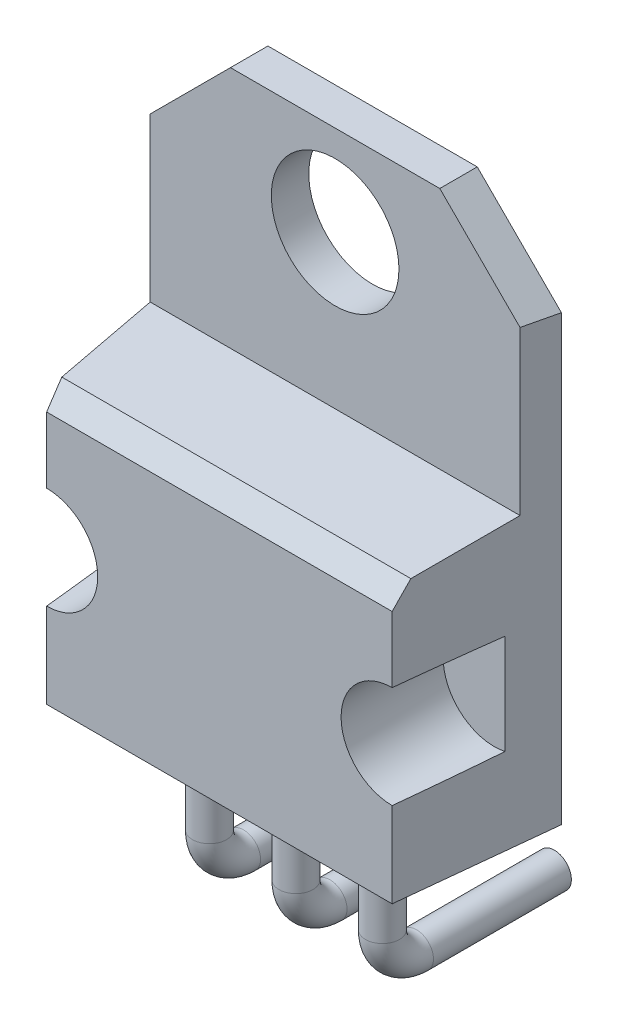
ISO-10303-21;
HEADER;
FILE_DESCRIPTION(('STEP AP214'),'2;1');
FILE_NAME('part.step','',(''),(''),'','','');
FILE_SCHEMA(('AUTOMOTIVE_DESIGN { 1 0 10303 214 1 1 1 1 }'));
ENDSEC;
DATA;
#1=APPLICATION_CONTEXT('core data for automotive mechanical design processes');
#2=APPLICATION_PROTOCOL_DEFINITION('international standard','automotive_design',2000,#1);
#3=PRODUCT_CONTEXT('',#1,'mechanical');
#4=PRODUCT('Part','Part','',(#3));
#5=PRODUCT_RELATED_PRODUCT_CATEGORY('part','',(#4));
#6=PRODUCT_DEFINITION_FORMATION('','',#4);
#7=PRODUCT_DEFINITION_CONTEXT('part definition',#1,'design');
#8=PRODUCT_DEFINITION('design','',#6,#7);
#9=PRODUCT_DEFINITION_SHAPE('','',#8);
#10=(LENGTH_UNIT() NAMED_UNIT(*) SI_UNIT(.MILLI.,.METRE.));
#11=(NAMED_UNIT(*) PLANE_ANGLE_UNIT() SI_UNIT($,.RADIAN.));
#12=(NAMED_UNIT(*) SI_UNIT($,.STERADIAN.) SOLID_ANGLE_UNIT());
#13=UNCERTAINTY_MEASURE_WITH_UNIT(LENGTH_MEASURE(1.E-05),#10,'distance_accuracy_value','');
#14=(GEOMETRIC_REPRESENTATION_CONTEXT(3) GLOBAL_UNCERTAINTY_ASSIGNED_CONTEXT((#13)) GLOBAL_UNIT_ASSIGNED_CONTEXT((#10,
#11,#12)) REPRESENTATION_CONTEXT('',''));
#15=CARTESIAN_POINT('',(0.,0.,0.));
#16=DIRECTION('',(0.,0.,1.));
#17=DIRECTION('',(1.,0.,0.));
#18=AXIS2_PLACEMENT_3D('',#15,#16,#17);
#19=CARTESIAN_POINT('',(0.,0.,1.1));
#20=DIRECTION('',(0.,1.,0.));
#21=DIRECTION('',(0.,0.,1.));
#22=AXIS2_PLACEMENT_3D('',#19,#20,#21);
#23=PLANE('',#22);
#24=CARTESIAN_POINT('',(7.615,0.,2.25));
#25=DIRECTION('',(0.,1.,0.));
#26=DIRECTION('',(0.,0.,-1.));
#27=AXIS2_PLACEMENT_3D('',#24,#25,#26);
#28=CIRCLE('',#27,0.5);
#29=CARTESIAN_POINT('',(7.615,0.,1.75));
#30=VERTEX_POINT('',#29);
#31=EDGE_CURVE('E369',#30,#30,#28,.T.);
#32=ORIENTED_EDGE('',*,*,#31,.T.);
#33=EDGE_LOOP('',(#32));
#34=FACE_BOUND('',#33,.T.);
#35=CARTESIAN_POINT('',(2.535,0.,2.25));
#36=DIRECTION('',(0.,1.,0.));
#37=DIRECTION('',(0.,0.,1.));
#38=AXIS2_PLACEMENT_3D('',#35,#36,#37);
#39=CIRCLE('',#38,0.5);
#40=CARTESIAN_POINT('',(2.535,0.,2.75));
#41=VERTEX_POINT('',#40);
#42=EDGE_CURVE('E39',#41,#41,#39,.F.);
#43=ORIENTED_EDGE('',*,*,#42,.F.);
#44=EDGE_LOOP('',(#43));
#45=FACE_BOUND('',#44,.T.);
#46=DIRECTION('',(1.,0.,0.));
#47=VECTOR('',#46,1.);
#48=CARTESIAN_POINT('',(0.,0.,0.));
#49=LINE('',#48,#47);
#50=CARTESIAN_POINT('',(-0.472969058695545,0.,0.));
#51=VERTEX_POINT('',#50);
#52=CARTESIAN_POINT('',(10.6229690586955,0.,0.));
#53=VERTEX_POINT('',#52);
#54=EDGE_CURVE('E179',#51,#53,#49,.T.);
#55=ORIENTED_EDGE('',*,*,#54,.T.);
#56=DIRECTION('',(-0.104528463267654,0.,0.994521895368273));
#57=VECTOR('',#56,1.);
#58=CARTESIAN_POINT('',(10.15,0.,4.5));
#59=LINE('',#58,#57);
#60=CARTESIAN_POINT('',(10.15,0.,4.5));
#61=VERTEX_POINT('',#60);
#62=EDGE_CURVE('E177',#61,#53,#59,.F.);
#63=ORIENTED_EDGE('',*,*,#62,.F.);
#64=DIRECTION('',(1.,0.,0.));
#65=VECTOR('',#64,1.);
#66=CARTESIAN_POINT('',(0.,0.,4.5));
#67=LINE('',#66,#65);
#68=CARTESIAN_POINT('',(0.,0.,4.5));
#69=VERTEX_POINT('',#68);
#70=EDGE_CURVE('E157',#69,#61,#67,.T.);
#71=ORIENTED_EDGE('',*,*,#70,.F.);
#72=DIRECTION('',(0.104528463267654,0.,0.994521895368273));
#73=VECTOR('',#72,1.);
#74=CARTESIAN_POINT('',(-0.353449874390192,0.,1.13714907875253));
#75=LINE('',#74,#73);
#76=EDGE_CURVE('E189',#69,#51,#75,.F.);
#77=ORIENTED_EDGE('',*,*,#76,.T.);
#78=EDGE_LOOP('',(#55,#63,#71,#77));
#79=FACE_BOUND('',#78,.T.);
#80=CARTESIAN_POINT('',(5.07499999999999,0.,2.25));
#81=DIRECTION('',(0.,-1.,0.));
#82=DIRECTION('',(0.,0.,-1.));
#83=AXIS2_PLACEMENT_3D('',#80,#81,#82);
#84=CIRCLE('',#83,0.500000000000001);
#85=CARTESIAN_POINT('',(5.07499999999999,0.,1.75));
#86=VERTEX_POINT('',#85);
#87=EDGE_CURVE('E11',#86,#86,#84,.T.);
#88=ORIENTED_EDGE('',*,*,#87,.F.);
#89=EDGE_LOOP('',(#88));
#90=FACE_BOUND('',#89,.T.);
#91=ADVANCED_FACE('F35',(#34,#45,#79,#90),#23,.F.);
#92=CARTESIAN_POINT('',(0.,15.5,1.1));
#93=DIRECTION('',(0.,0.,-1.));
#94=DIRECTION('',(-1.,0.,0.));
#95=AXIS2_PLACEMENT_3D('',#92,#93,#94);
#96=PLANE('',#95);
#97=CARTESIAN_POINT('',(5.075,12.85,1.1));
#98=DIRECTION('',(0.,0.,1.));
#99=DIRECTION('',(1.,0.,0.));
#100=AXIS2_PLACEMENT_3D('',#97,#98,#99);
#101=CIRCLE('',#100,1.875);
#102=CARTESIAN_POINT('',(6.94999999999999,12.85,1.1));
#103=VERTEX_POINT('',#102);
#104=EDGE_CURVE('E171',#103,#103,#101,.T.);
#105=ORIENTED_EDGE('',*,*,#104,.F.);
#106=EDGE_LOOP('',(#105));
#107=FACE_BOUND('',#106,.T.);
#108=DIRECTION('',(1.,0.,0.));
#109=VECTOR('',#108,1.);
#110=CARTESIAN_POINT('',(0.,8.3573543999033,1.1));
#111=LINE('',#110,#109);
#112=CARTESIAN_POINT('',(10.5073543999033,8.3573543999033,1.1));
#113=VERTEX_POINT('',#112);
#114=CARTESIAN_POINT('',(-0.357354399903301,8.3573543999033,1.1));
#115=VERTEX_POINT('',#114);
#116=EDGE_CURVE('E217',#113,#115,#111,.F.);
#117=ORIENTED_EDGE('',*,*,#116,.F.);
#118=DIRECTION('',(0.,-1.,0.));
#119=VECTOR('',#118,1.);
#120=CARTESIAN_POINT('',(10.5073543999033,15.5,1.1));
#121=LINE('',#120,#119);
#122=CARTESIAN_POINT('',(10.5073543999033,13.1426456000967,1.1));
#123=VERTEX_POINT('',#122);
#124=EDGE_CURVE('E178',#113,#123,#121,.F.);
#125=ORIENTED_EDGE('',*,*,#124,.T.);
#126=DIRECTION('',(0.707106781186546,-0.707106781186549,0.));
#127=VECTOR('',#126,1.);
#128=CARTESIAN_POINT('',(8.15,15.5,1.1));
#129=LINE('',#128,#127);
#130=CARTESIAN_POINT('',(8.14999999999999,15.5,1.1));
#131=VERTEX_POINT('',#130);
#132=EDGE_CURVE('E199',#123,#131,#129,.F.);
#133=ORIENTED_EDGE('',*,*,#132,.T.);
#134=DIRECTION('',(-1.,0.,0.));
#135=VECTOR('',#134,1.);
#136=CARTESIAN_POINT('',(0.,15.5,1.1));
#137=LINE('',#136,#135);
#138=CARTESIAN_POINT('',(2.,15.5,1.1));
#139=VERTEX_POINT('',#138);
#140=EDGE_CURVE('E174',#131,#139,#137,.T.);
#141=ORIENTED_EDGE('',*,*,#140,.T.);
#142=DIRECTION('',(0.707106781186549,0.707106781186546,0.));
#143=VECTOR('',#142,1.);
#144=CARTESIAN_POINT('',(0.,13.5,1.1));
#145=LINE('',#144,#143);
#146=CARTESIAN_POINT('',(-0.357354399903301,13.1426456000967,1.1));
#147=VERTEX_POINT('',#146);
#148=EDGE_CURVE('E197',#139,#147,#145,.F.);
#149=ORIENTED_EDGE('',*,*,#148,.T.);
#150=DIRECTION('',(0.,1.,0.));
#151=VECTOR('',#150,1.);
#152=CARTESIAN_POINT('',(-0.357354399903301,15.5,1.1));
#153=LINE('',#152,#151);
#154=EDGE_CURVE('E185',#147,#115,#153,.F.);
#155=ORIENTED_EDGE('',*,*,#154,.T.);
#156=EDGE_LOOP('',(#117,#125,#133,#141,#149,#155));
#157=FACE_BOUND('',#156,.T.);
#158=ADVANCED_FACE('F251',(#107,#157),#96,.F.);
#159=CARTESIAN_POINT('',(0.,0.,4.5));
#160=DIRECTION('',(-0.994521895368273,0.,0.104528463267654));
#161=DIRECTION('',(0.104528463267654,0.,0.994521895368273));
#162=AXIS2_PLACEMENT_3D('',#159,#160,#161);
#163=PLANE('',#162);
#164=DIRECTION('',(0.,-1.,0.));
#165=VECTOR('',#164,1.);
#166=CARTESIAN_POINT('',(0.,0.,4.5));
#167=LINE('',#166,#165);
#168=CARTESIAN_POINT('',(0.,7.43819810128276,4.5));
#169=VERTEX_POINT('',#168);
#170=CARTESIAN_POINT('',(0.,5.5,4.5));
#171=VERTEX_POINT('',#170);
#172=EDGE_CURVE('E223',#169,#171,#167,.T.);
#173=ORIENTED_EDGE('',*,*,#172,.F.);
#174=DIRECTION('',(0.0660000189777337,-0.77545148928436,0.627948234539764));
#175=VECTOR('',#174,1.);
#176=CARTESIAN_POINT('',(0.,7.43819810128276,4.5));
#177=LINE('',#176,#175);
#178=CARTESIAN_POINT('',(-0.0522642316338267,8.05226423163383,4.00273905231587));
#179=VERTEX_POINT('',#178);
#180=EDGE_CURVE('E59',#169,#179,#177,.F.);
#181=ORIENTED_EDGE('',*,*,#180,.T.);
#182=DIRECTION('',(-0.103962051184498,0.103962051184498,-0.989132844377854));
#183=VECTOR('',#182,1.);
#184=CARTESIAN_POINT('',(0.0864648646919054,7.9135351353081,5.32265823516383));
#185=LINE('',#184,#183);
#186=EDGE_CURVE('E158',#179,#115,#185,.T.);
#187=ORIENTED_EDGE('',*,*,#186,.T.);
#188=ORIENTED_EDGE('',*,*,#154,.F.);
#189=DIRECTION('',(-0.103962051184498,-0.103962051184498,-0.989132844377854));
#190=VECTOR('',#189,1.);
#191=CARTESIAN_POINT('',(-0.349629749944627,13.1503702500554,1.17349513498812));
#192=LINE('',#191,#190);
#193=CARTESIAN_POINT('',(-0.472969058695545,13.0270309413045,0.));
#194=VERTEX_POINT('',#193);
#195=EDGE_CURVE('E200',#147,#194,#192,.T.);
#196=ORIENTED_EDGE('',*,*,#195,.T.);
#197=DIRECTION('',(0.,1.,0.));
#198=VECTOR('',#197,1.);
#199=CARTESIAN_POINT('',(-0.472969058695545,15.5,0.));
#200=LINE('',#199,#198);
#201=EDGE_CURVE('E170',#194,#51,#200,.F.);
#202=ORIENTED_EDGE('',*,*,#201,.T.);
#203=ORIENTED_EDGE('',*,*,#76,.F.);
#204=DIRECTION('',(0.,1.,0.));
#205=VECTOR('',#204,1.);
#206=CARTESIAN_POINT('',(0.,8.,4.5));
#207=LINE('',#206,#205);
#208=CARTESIAN_POINT('',(0.,2.5,4.5));
#209=VERTEX_POINT('',#208);
#210=EDGE_CURVE('E221',#209,#69,#207,.F.);
#211=ORIENTED_EDGE('',*,*,#210,.F.);
#212=CARTESIAN_POINT('',(0.,4.,4.5));
#213=DIRECTION('',(-0.994521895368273,0.,0.104528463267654));
#214=DIRECTION('',(0.104528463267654,0.,0.994521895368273));
#215=AXIS2_PLACEMENT_3D('',#212,#213,#214);
#216=ELLIPSE('',#215,14.3501583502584,1.5);
#217=CARTESIAN_POINT('',(-0.31531270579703,2.53351512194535,1.5));
#218=VERTEX_POINT('',#217);
#219=EDGE_CURVE('E204',#209,#218,#216,.F.);
#220=ORIENTED_EDGE('',*,*,#219,.T.);
#221=DIRECTION('',(0.,1.,0.));
#222=VECTOR('',#221,1.);
#223=CARTESIAN_POINT('',(-0.31531270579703,0.,1.5));
#224=LINE('',#223,#222);
#225=CARTESIAN_POINT('',(-0.31531270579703,5.46648487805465,1.5));
#226=VERTEX_POINT('',#225);
#227=EDGE_CURVE('E208',#226,#218,#224,.F.);
#228=ORIENTED_EDGE('',*,*,#227,.F.);
#229=CARTESIAN_POINT('',(0.,4.,4.5));
#230=DIRECTION('',(-0.994521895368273,0.,0.104528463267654));
#231=DIRECTION('',(0.104528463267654,0.,0.994521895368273));
#232=AXIS2_PLACEMENT_3D('',#229,#230,#231);
#233=ELLIPSE('',#232,14.3501583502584,1.5);
#234=EDGE_CURVE('E214',#226,#171,#233,.F.);
#235=ORIENTED_EDGE('',*,*,#234,.T.);
#236=EDGE_LOOP('',(#173,#181,#187,#188,#196,#202,#203,#211,#220,#228,#235));
#237=FACE_BOUND('',#236,.T.);
#238=ADVANCED_FACE('F320',(#237),#163,.T.);
#239=CARTESIAN_POINT('',(10.15,0.,4.5));
#240=DIRECTION('',(0.994521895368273,0.,0.104528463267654));
#241=DIRECTION('',(0.104528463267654,0.,-0.994521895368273));
#242=AXIS2_PLACEMENT_3D('',#239,#240,#241);
#243=PLANE('',#242);
#244=DIRECTION('',(0.103962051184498,0.103962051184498,-0.989132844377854));
#245=VECTOR('',#244,1.);
#246=CARTESIAN_POINT('',(10.0402977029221,7.89029770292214,5.54374763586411));
#247=LINE('',#246,#245);
#248=CARTESIAN_POINT('',(10.2022642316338,8.05226423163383,4.00273905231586));
#249=VERTEX_POINT('',#248);
#250=EDGE_CURVE('E161',#249,#113,#247,.T.);
#251=ORIENTED_EDGE('',*,*,#250,.F.);
#252=DIRECTION('',(0.0660000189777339,0.77545148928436,-0.627948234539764));
#253=VECTOR('',#252,1.);
#254=CARTESIAN_POINT('',(10.1057865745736,6.9187229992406,4.92066264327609));
#255=LINE('',#254,#253);
#256=CARTESIAN_POINT('',(10.15,7.43819810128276,4.5));
#257=VERTEX_POINT('',#256);
#258=EDGE_CURVE('E242',#249,#257,#255,.F.);
#259=ORIENTED_EDGE('',*,*,#258,.T.);
#260=DIRECTION('',(0.,-1.,0.));
#261=VECTOR('',#260,1.);
#262=CARTESIAN_POINT('',(10.15,8.,4.5));
#263=LINE('',#262,#261);
#264=CARTESIAN_POINT('',(10.15,5.5,4.5));
#265=VERTEX_POINT('',#264);
#266=EDGE_CURVE('E159',#265,#257,#263,.F.);
#267=ORIENTED_EDGE('',*,*,#266,.F.);
#268=CARTESIAN_POINT('',(10.15,4.,4.49999999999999));
#269=DIRECTION('',(0.994521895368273,0.,0.104528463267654));
#270=DIRECTION('',(-0.104528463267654,0.,0.994521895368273));
#271=AXIS2_PLACEMENT_3D('',#268,#269,#270);
#272=ELLIPSE('',#271,14.3501583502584,1.5);
#273=CARTESIAN_POINT('',(10.465312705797,5.46648487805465,1.5));
#274=VERTEX_POINT('',#273);
#275=EDGE_CURVE('E137',#265,#274,#272,.F.);
#276=ORIENTED_EDGE('',*,*,#275,.T.);
#277=DIRECTION('',(0.,-1.,0.));
#278=VECTOR('',#277,1.);
#279=CARTESIAN_POINT('',(10.465312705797,0.,1.5));
#280=LINE('',#279,#278);
#281=CARTESIAN_POINT('',(10.465312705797,2.53351512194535,1.5));
#282=VERTEX_POINT('',#281);
#283=EDGE_CURVE('E151',#282,#274,#280,.F.);
#284=ORIENTED_EDGE('',*,*,#283,.F.);
#285=CARTESIAN_POINT('',(10.15,4.,4.49999999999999));
#286=DIRECTION('',(0.994521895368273,0.,0.104528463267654));
#287=DIRECTION('',(-0.104528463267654,0.,0.994521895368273));
#288=AXIS2_PLACEMENT_3D('',#285,#286,#287);
#289=ELLIPSE('',#288,14.3501583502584,1.5);
#290=CARTESIAN_POINT('',(10.15,2.5,4.5));
#291=VERTEX_POINT('',#290);
#292=EDGE_CURVE('E134',#282,#291,#289,.F.);
#293=ORIENTED_EDGE('',*,*,#292,.T.);
#294=DIRECTION('',(0.,1.,0.));
#295=VECTOR('',#294,1.);
#296=CARTESIAN_POINT('',(10.15,0.,4.5));
#297=LINE('',#296,#295);
#298=EDGE_CURVE('E150',#61,#291,#297,.T.);
#299=ORIENTED_EDGE('',*,*,#298,.F.);
#300=ORIENTED_EDGE('',*,*,#62,.T.);
#301=DIRECTION('',(0.,-1.,0.));
#302=VECTOR('',#301,1.);
#303=CARTESIAN_POINT('',(10.6229690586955,15.5,0.));
#304=LINE('',#303,#302);
#305=CARTESIAN_POINT('',(10.6229690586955,13.0270309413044,0.));
#306=VERTEX_POINT('',#305);
#307=EDGE_CURVE('E181',#53,#306,#304,.F.);
#308=ORIENTED_EDGE('',*,*,#307,.T.);
#309=DIRECTION('',(-0.103962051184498,0.103962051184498,0.989132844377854));
#310=VECTOR('',#309,1.);
#311=CARTESIAN_POINT('',(10.4563973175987,13.1936026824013,1.58482425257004));
#312=LINE('',#311,#310);
#313=EDGE_CURVE('E196',#306,#123,#312,.T.);
#314=ORIENTED_EDGE('',*,*,#313,.T.);
#315=ORIENTED_EDGE('',*,*,#124,.F.);
#316=EDGE_LOOP('',(#251,#259,#267,#276,#284,#293,#299,#300,#308,#314,#315));
#317=FACE_BOUND('',#316,.T.);
#318=ADVANCED_FACE('F148',(#317),#243,.T.);
#319=CARTESIAN_POINT('',(0.,15.5,1.1));
#320=DIRECTION('',(0.,-1.,0.));
#321=DIRECTION('',(0.,0.,-1.));
#322=AXIS2_PLACEMENT_3D('',#319,#320,#321);
#323=PLANE('',#322);
#324=ORIENTED_EDGE('',*,*,#140,.F.);
#325=DIRECTION('',(0.,0.,-1.));
#326=VECTOR('',#325,1.);
#327=CARTESIAN_POINT('',(8.15,15.5,1.1));
#328=LINE('',#327,#326);
#329=CARTESIAN_POINT('',(8.15,15.5,0.));
#330=VERTEX_POINT('',#329);
#331=EDGE_CURVE('E188',#131,#330,#328,.T.);
#332=ORIENTED_EDGE('',*,*,#331,.T.);
#333=DIRECTION('',(-1.,0.,0.));
#334=VECTOR('',#333,1.);
#335=CARTESIAN_POINT('',(0.,15.5,0.));
#336=LINE('',#335,#334);
#337=CARTESIAN_POINT('',(2.,15.5,0.));
#338=VERTEX_POINT('',#337);
#339=EDGE_CURVE('E182',#330,#338,#336,.T.);
#340=ORIENTED_EDGE('',*,*,#339,.T.);
#341=DIRECTION('',(0.,0.,1.));
#342=VECTOR('',#341,1.);
#343=CARTESIAN_POINT('',(2.,15.5,1.1));
#344=LINE('',#343,#342);
#345=EDGE_CURVE('E186',#338,#139,#344,.T.);
#346=ORIENTED_EDGE('',*,*,#345,.T.);
#347=EDGE_LOOP('',(#324,#332,#340,#346));
#348=FACE_BOUND('',#347,.T.);
#349=ADVANCED_FACE('F324',(#348),#323,.F.);
#350=CARTESIAN_POINT('',(0.,15.5,0.));
#351=DIRECTION('',(0.,0.,-1.));
#352=DIRECTION('',(-1.,0.,0.));
#353=AXIS2_PLACEMENT_3D('',#350,#351,#352);
#354=PLANE('',#353);
#355=CARTESIAN_POINT('',(5.075,12.85,0.));
#356=DIRECTION('',(0.,0.,1.));
#357=DIRECTION('',(1.,0.,0.));
#358=AXIS2_PLACEMENT_3D('',#355,#356,#357);
#359=CIRCLE('',#358,1.875);
#360=CARTESIAN_POINT('',(6.94999999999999,12.85,0.));
#361=VERTEX_POINT('',#360);
#362=EDGE_CURVE('E167',#361,#361,#359,.T.);
#363=ORIENTED_EDGE('',*,*,#362,.T.);
#364=EDGE_LOOP('',(#363));
#365=FACE_BOUND('',#364,.T.);
#366=ORIENTED_EDGE('',*,*,#339,.F.);
#367=DIRECTION('',(-0.707106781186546,0.707106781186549,0.));
#368=VECTOR('',#367,1.);
#369=CARTESIAN_POINT('',(4.07500000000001,19.575,0.));
#370=LINE('',#369,#368);
#371=EDGE_CURVE('E194',#330,#306,#370,.F.);
#372=ORIENTED_EDGE('',*,*,#371,.T.);
#373=ORIENTED_EDGE('',*,*,#307,.F.);
#374=ORIENTED_EDGE('',*,*,#54,.F.);
#375=ORIENTED_EDGE('',*,*,#201,.F.);
#376=DIRECTION('',(-0.707106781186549,-0.707106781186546,0.));
#377=VECTOR('',#376,1.);
#378=CARTESIAN_POINT('',(0.999999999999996,14.5,0.));
#379=LINE('',#378,#377);
#380=EDGE_CURVE('E192',#194,#338,#379,.F.);
#381=ORIENTED_EDGE('',*,*,#380,.T.);
#382=EDGE_LOOP('',(#366,#372,#373,#374,#375,#381));
#383=FACE_BOUND('',#382,.T.);
#384=ADVANCED_FACE('F316',(#365,#383),#354,.T.);
#385=CARTESIAN_POINT('',(5.075,12.85,0.));
#386=DIRECTION('',(0.,0.,1.));
#387=DIRECTION('',(1.,0.,0.));
#388=AXIS2_PLACEMENT_3D('',#385,#386,#387);
#389=CYLINDRICAL_SURFACE('',#388,1.875);
#390=ORIENTED_EDGE('',*,*,#362,.F.);
#391=EDGE_LOOP('',(#390));
#392=FACE_BOUND('',#391,.T.);
#393=ORIENTED_EDGE('',*,*,#104,.T.);
#394=EDGE_LOOP('',(#393));
#395=FACE_BOUND('',#394,.T.);
#396=ADVANCED_FACE('F312',(#392,#395),#389,.F.);
#397=CARTESIAN_POINT('',(8.15,15.5,1.1));
#398=DIRECTION('',(-0.707106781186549,-0.707106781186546,0.));
#399=DIRECTION('',(0.707106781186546,-0.707106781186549,0.));
#400=AXIS2_PLACEMENT_3D('',#397,#398,#399);
#401=PLANE('',#400);
#402=ORIENTED_EDGE('',*,*,#132,.F.);
#403=ORIENTED_EDGE('',*,*,#313,.F.);
#404=ORIENTED_EDGE('',*,*,#371,.F.);
#405=ORIENTED_EDGE('',*,*,#331,.F.);
#406=EDGE_LOOP('',(#402,#403,#404,#405));
#407=FACE_BOUND('',#406,.T.);
#408=ADVANCED_FACE('F315',(#407),#401,.F.);
#409=CARTESIAN_POINT('',(0.,13.5,1.1));
#410=DIRECTION('',(0.707106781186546,-0.707106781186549,0.));
#411=DIRECTION('',(0.707106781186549,0.707106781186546,0.));
#412=AXIS2_PLACEMENT_3D('',#409,#410,#411);
#413=PLANE('',#412);
#414=ORIENTED_EDGE('',*,*,#148,.F.);
#415=ORIENTED_EDGE('',*,*,#345,.F.);
#416=ORIENTED_EDGE('',*,*,#380,.F.);
#417=ORIENTED_EDGE('',*,*,#195,.F.);
#418=EDGE_LOOP('',(#414,#415,#416,#417));
#419=FACE_BOUND('',#418,.T.);
#420=ADVANCED_FACE('F331',(#419),#413,.F.);
#421=CARTESIAN_POINT('',(0.,8.,4.5));
#422=DIRECTION('',(0.,0.994521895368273,0.104528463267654));
#423=DIRECTION('',(0.,-0.104528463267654,0.994521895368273));
#424=AXIS2_PLACEMENT_3D('',#421,#422,#423);
#425=PLANE('',#424);
#426=ORIENTED_EDGE('',*,*,#186,.F.);
#427=DIRECTION('',(-1.,0.,0.));
#428=VECTOR('',#427,1.);
#429=CARTESIAN_POINT('',(0.,8.05226423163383,4.00273905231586));
#430=LINE('',#429,#428);
#431=EDGE_CURVE('E51',#179,#249,#430,.F.);
#432=ORIENTED_EDGE('',*,*,#431,.T.);
#433=ORIENTED_EDGE('',*,*,#250,.T.);
#434=ORIENTED_EDGE('',*,*,#116,.T.);
#435=EDGE_LOOP('',(#426,#432,#433,#434));
#436=FACE_BOUND('',#435,.T.);
#437=ADVANCED_FACE('F311',(#436),#425,.T.);
#438=CARTESIAN_POINT('',(0.,8.,4.5));
#439=DIRECTION('',(0.,0.,-1.));
#440=DIRECTION('',(-1.,0.,0.));
#441=AXIS2_PLACEMENT_3D('',#438,#439,#440);
#442=PLANE('',#441);
#443=ORIENTED_EDGE('',*,*,#266,.T.);
#444=DIRECTION('',(-1.,0.,0.));
#445=VECTOR('',#444,1.);
#446=CARTESIAN_POINT('',(0.,7.43819810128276,4.5));
#447=LINE('',#446,#445);
#448=EDGE_CURVE('E212',#257,#169,#447,.T.);
#449=ORIENTED_EDGE('',*,*,#448,.T.);
#450=ORIENTED_EDGE('',*,*,#172,.T.);
#451=CARTESIAN_POINT('',(0.,4.,4.5));
#452=DIRECTION('',(0.,0.,-1.));
#453=DIRECTION('',(-1.,0.,0.));
#454=AXIS2_PLACEMENT_3D('',#451,#452,#453);
#455=CIRCLE('',#454,1.5);
#456=EDGE_CURVE('E205',#171,#209,#455,.T.);
#457=ORIENTED_EDGE('',*,*,#456,.T.);
#458=ORIENTED_EDGE('',*,*,#210,.T.);
#459=ORIENTED_EDGE('',*,*,#70,.T.);
#460=ORIENTED_EDGE('',*,*,#298,.T.);
#461=CARTESIAN_POINT('',(10.15,4.,4.5));
#462=DIRECTION('',(0.,0.,1.));
#463=DIRECTION('',(1.,0.,0.));
#464=AXIS2_PLACEMENT_3D('',#461,#462,#463);
#465=CIRCLE('',#464,1.5);
#466=EDGE_CURVE('E130',#265,#291,#465,.T.);
#467=ORIENTED_EDGE('',*,*,#466,.F.);
#468=EDGE_LOOP('',(#443,#449,#450,#457,#458,#459,#460,#467));
#469=FACE_BOUND('',#468,.T.);
#470=ADVANCED_FACE('F155',(#469),#442,.F.);
#471=CARTESIAN_POINT('',(0.,4.,1.5));
#472=DIRECTION('',(0.,0.,1.));
#473=DIRECTION('',(1.,0.,0.));
#474=AXIS2_PLACEMENT_3D('',#471,#472,#473);
#475=PLANE('',#474);
#476=ORIENTED_EDGE('',*,*,#227,.T.);
#477=CARTESIAN_POINT('',(0.,4.,1.5));
#478=DIRECTION('',(0.,0.,1.));
#479=DIRECTION('',(1.,0.,0.));
#480=AXIS2_PLACEMENT_3D('',#477,#478,#479);
#481=CIRCLE('',#480,1.5);
#482=EDGE_CURVE('E152',#218,#226,#481,.T.);
#483=ORIENTED_EDGE('',*,*,#482,.T.);
#484=EDGE_LOOP('',(#476,#483));
#485=FACE_BOUND('',#484,.T.);
#486=ADVANCED_FACE('F302',(#485),#475,.T.);
#487=CARTESIAN_POINT('',(0.,4.,1.5));
#488=DIRECTION('',(0.,0.,1.));
#489=DIRECTION('',(1.,0.,0.));
#490=AXIS2_PLACEMENT_3D('',#487,#488,#489);
#491=CYLINDRICAL_SURFACE('',#490,1.5);
#492=ORIENTED_EDGE('',*,*,#482,.F.);
#493=ORIENTED_EDGE('',*,*,#219,.F.);
#494=ORIENTED_EDGE('',*,*,#456,.F.);
#495=ORIENTED_EDGE('',*,*,#234,.F.);
#496=EDGE_LOOP('',(#492,#493,#494,#495));
#497=FACE_BOUND('',#496,.T.);
#498=ADVANCED_FACE('F298',(#497),#491,.F.);
#499=CARTESIAN_POINT('',(10.15,4.,1.5));
#500=DIRECTION('',(0.,0.,1.));
#501=DIRECTION('',(1.,0.,0.));
#502=AXIS2_PLACEMENT_3D('',#499,#500,#501);
#503=PLANE('',#502);
#504=ORIENTED_EDGE('',*,*,#283,.T.);
#505=CARTESIAN_POINT('',(10.15,4.,1.5));
#506=DIRECTION('',(0.,0.,1.));
#507=DIRECTION('',(1.,0.,0.));
#508=AXIS2_PLACEMENT_3D('',#505,#506,#507);
#509=CIRCLE('',#508,1.5);
#510=EDGE_CURVE('E142',#274,#282,#509,.T.);
#511=ORIENTED_EDGE('',*,*,#510,.T.);
#512=EDGE_LOOP('',(#504,#511));
#513=FACE_BOUND('',#512,.T.);
#514=ADVANCED_FACE('F295',(#513),#503,.T.);
#515=CARTESIAN_POINT('',(10.15,4.,1.5));
#516=DIRECTION('',(0.,0.,1.));
#517=DIRECTION('',(1.,0.,0.));
#518=AXIS2_PLACEMENT_3D('',#515,#516,#517);
#519=CYLINDRICAL_SURFACE('',#518,1.5);
#520=ORIENTED_EDGE('',*,*,#510,.F.);
#521=ORIENTED_EDGE('',*,*,#275,.F.);
#522=ORIENTED_EDGE('',*,*,#466,.T.);
#523=ORIENTED_EDGE('',*,*,#292,.F.);
#524=EDGE_LOOP('',(#520,#521,#522,#523));
#525=FACE_BOUND('',#524,.T.);
#526=ADVANCED_FACE('F133',(#525),#519,.F.);
#527=CARTESIAN_POINT('',(0.,7.43819810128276,4.5));
#528=DIRECTION('',(0.,0.629320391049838,0.777145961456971));
#529=DIRECTION('',(0.,-0.777145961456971,0.629320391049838));
#530=AXIS2_PLACEMENT_3D('',#527,#528,#529);
#531=PLANE('',#530);
#532=ORIENTED_EDGE('',*,*,#258,.F.);
#533=ORIENTED_EDGE('',*,*,#431,.F.);
#534=ORIENTED_EDGE('',*,*,#180,.F.);
#535=ORIENTED_EDGE('',*,*,#448,.F.);
#536=EDGE_LOOP('',(#532,#533,#534,#535));
#537=FACE_BOUND('',#536,.T.);
#538=ADVANCED_FACE('F37',(#537),#531,.T.);
#539=CARTESIAN_POINT('',(2.535,-4.05,1.24999999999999));
#540=DIRECTION('',(0.,0.,-1.));
#541=DIRECTION('',(-1.,0.,0.));
#542=AXIS2_PLACEMENT_3D('',#539,#540,#541);
#543=CYLINDRICAL_SURFACE('',#542,0.5);
#544=CARTESIAN_POINT('',(2.535,-4.05,1.24999999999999));
#545=DIRECTION('',(0.,0.,-1.));
#546=DIRECTION('',(0.,1.,0.));
#547=AXIS2_PLACEMENT_3D('',#544,#545,#546);
#548=CIRCLE('',#547,0.5);
#549=CARTESIAN_POINT('',(2.535,-4.55,1.24999999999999));
#550=VERTEX_POINT('',#549);
#551=EDGE_CURVE('E347',#550,#550,#548,.T.);
#552=ORIENTED_EDGE('',*,*,#551,.T.);
#553=EDGE_LOOP('',(#552));
#554=FACE_BOUND('',#553,.T.);
#555=CARTESIAN_POINT('',(2.535,-4.05,-2.8));
#556=DIRECTION('',(0.,0.,-1.));
#557=DIRECTION('',(0.,1.,0.));
#558=AXIS2_PLACEMENT_3D('',#555,#556,#557);
#559=CIRCLE('',#558,0.5);
#560=CARTESIAN_POINT('',(2.535,-3.55,-2.79999999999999));
#561=VERTEX_POINT('',#560);
#562=EDGE_CURVE('E143',#561,#561,#559,.T.);
#563=ORIENTED_EDGE('',*,*,#562,.F.);
#564=EDGE_LOOP('',(#563));
#565=FACE_BOUND('',#564,.T.);
#566=ADVANCED_FACE('F290',(#554,#565),#543,.T.);
#567=CARTESIAN_POINT('',(2.535,-3.05,1.25));
#568=DIRECTION('',(1.,0.,0.));
#569=DIRECTION('',(0.,0.,-1.));
#570=AXIS2_PLACEMENT_3D('',#567,#568,#569);
#571=TOROIDAL_SURFACE('',#570,0.999999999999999,0.5);
#572=CARTESIAN_POINT('',(2.535,-3.04999999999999,2.25));
#573=DIRECTION('',(0.,-1.,0.));
#574=DIRECTION('',(0.,0.,-1.));
#575=AXIS2_PLACEMENT_3D('',#572,#573,#574);
#576=CIRCLE('',#575,0.5);
#577=CARTESIAN_POINT('',(2.535,-3.04999999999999,2.75));
#578=VERTEX_POINT('',#577);
#579=EDGE_CURVE('E350',#578,#578,#576,.T.);
#580=CARTESIAN_POINT('',(2.535,-3.05,1.25));
#581=DIRECTION('',(1.,0.,0.));
#582=DIRECTION('',(0.,0.,-1.));
#583=AXIS2_PLACEMENT_3D('',#580,#581,#582);
#584=CIRCLE('',#583,1.5);
#585=EDGE_CURVE('',#578,#550,#584,.T.);
#586=ORIENTED_EDGE('',*,*,#579,.T.);
#587=ORIENTED_EDGE('',*,*,#551,.F.);
#588=ORIENTED_EDGE('',*,*,#585,.T.);
#589=ORIENTED_EDGE('',*,*,#585,.F.);
#590=EDGE_LOOP('',(#586,#588,#587,#589));
#591=FACE_BOUND('',#590,.T.);
#592=ADVANCED_FACE('F286',(#591),#571,.T.);
#593=CARTESIAN_POINT('',(2.535,-3.04999999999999,2.25));
#594=DIRECTION('',(0.,1.,0.));
#595=DIRECTION('',(0.,0.,1.));
#596=AXIS2_PLACEMENT_3D('',#593,#594,#595);
#597=CYLINDRICAL_SURFACE('',#596,0.5);
#598=ORIENTED_EDGE('',*,*,#579,.F.);
#599=EDGE_LOOP('',(#598));
#600=FACE_BOUND('',#599,.T.);
#601=ORIENTED_EDGE('',*,*,#42,.T.);
#602=EDGE_LOOP('',(#601));
#603=FACE_BOUND('',#602,.T.);
#604=ADVANCED_FACE('F247',(#600,#603),#597,.T.);
#605=CARTESIAN_POINT('',(2.535,-4.05,-2.8));
#606=DIRECTION('',(0.,0.,-1.));
#607=DIRECTION('',(0.,1.,0.));
#608=AXIS2_PLACEMENT_3D('',#605,#606,#607);
#609=PLANE('',#608);
#610=ORIENTED_EDGE('',*,*,#562,.T.);
#611=EDGE_LOOP('',(#610));
#612=FACE_BOUND('',#611,.T.);
#613=ADVANCED_FACE('F279',(#612),#609,.T.);
#614=CARTESIAN_POINT('',(5.07499999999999,-4.05,1.24999999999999));
#615=DIRECTION('',(0.,0.,-1.));
#616=DIRECTION('',(-1.,0.,0.));
#617=AXIS2_PLACEMENT_3D('',#614,#615,#616);
#618=CYLINDRICAL_SURFACE('',#617,0.500000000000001);
#619=CARTESIAN_POINT('',(5.07499999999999,-4.05,1.24999999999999));
#620=DIRECTION('',(0.,0.,-1.));
#621=DIRECTION('',(0.,1.,0.));
#622=AXIS2_PLACEMENT_3D('',#619,#620,#621);
#623=CIRCLE('',#622,0.500000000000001);
#624=CARTESIAN_POINT('',(5.07499999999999,-4.55,1.24999999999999));
#625=VERTEX_POINT('',#624);
#626=EDGE_CURVE('E356',#625,#625,#623,.T.);
#627=ORIENTED_EDGE('',*,*,#626,.T.);
#628=EDGE_LOOP('',(#627));
#629=FACE_BOUND('',#628,.T.);
#630=CARTESIAN_POINT('',(5.07499999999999,-4.05,-2.80000000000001));
#631=DIRECTION('',(0.,0.,-1.));
#632=DIRECTION('',(0.,1.,0.));
#633=AXIS2_PLACEMENT_3D('',#630,#631,#632);
#634=CIRCLE('',#633,0.500000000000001);
#635=CARTESIAN_POINT('',(5.07499999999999,-3.55,-2.8));
#636=VERTEX_POINT('',#635);
#637=EDGE_CURVE('E353',#636,#636,#634,.T.);
#638=ORIENTED_EDGE('',*,*,#637,.F.);
#639=EDGE_LOOP('',(#638));
#640=FACE_BOUND('',#639,.T.);
#641=ADVANCED_FACE('F271',(#629,#640),#618,.T.);
#642=CARTESIAN_POINT('',(5.07499999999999,-3.05,1.25));
#643=DIRECTION('',(1.,0.,0.));
#644=DIRECTION('',(0.,0.,-1.));
#645=AXIS2_PLACEMENT_3D('',#642,#643,#644);
#646=TOROIDAL_SURFACE('',#645,1.,0.500000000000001);
#647=CARTESIAN_POINT('',(5.07499999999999,-3.04999999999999,2.25));
#648=DIRECTION('',(0.,-1.,0.));
#649=DIRECTION('',(0.,0.,-1.));
#650=AXIS2_PLACEMENT_3D('',#647,#648,#649);
#651=CIRCLE('',#650,0.500000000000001);
#652=CARTESIAN_POINT('',(5.07499999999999,-3.04999999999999,2.75));
#653=VERTEX_POINT('',#652);
#654=EDGE_CURVE('E358',#653,#653,#651,.T.);
#655=CARTESIAN_POINT('',(5.07499999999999,-3.05,1.25));
#656=DIRECTION('',(1.,0.,0.));
#657=DIRECTION('',(0.,0.,-1.));
#658=AXIS2_PLACEMENT_3D('',#655,#656,#657);
#659=CIRCLE('',#658,1.5);
#660=EDGE_CURVE('',#653,#625,#659,.T.);
#661=ORIENTED_EDGE('',*,*,#654,.T.);
#662=ORIENTED_EDGE('',*,*,#626,.F.);
#663=ORIENTED_EDGE('',*,*,#660,.T.);
#664=ORIENTED_EDGE('',*,*,#660,.F.);
#665=EDGE_LOOP('',(#661,#663,#662,#664));
#666=FACE_BOUND('',#665,.T.);
#667=ADVANCED_FACE('F261',(#666),#646,.T.);
#668=CARTESIAN_POINT('',(5.07499999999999,-3.04999999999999,2.25));
#669=DIRECTION('',(0.,1.,0.));
#670=DIRECTION('',(0.,0.,1.));
#671=AXIS2_PLACEMENT_3D('',#668,#669,#670);
#672=CYLINDRICAL_SURFACE('',#671,0.500000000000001);
#673=ORIENTED_EDGE('',*,*,#654,.F.);
#674=EDGE_LOOP('',(#673));
#675=FACE_BOUND('',#674,.T.);
#676=ORIENTED_EDGE('',*,*,#87,.T.);
#677=EDGE_LOOP('',(#676));
#678=FACE_BOUND('',#677,.T.);
#679=ADVANCED_FACE('F258',(#675,#678),#672,.T.);
#680=CARTESIAN_POINT('',(5.07499999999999,-4.05,-2.80000000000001));
#681=DIRECTION('',(0.,0.,-1.));
#682=DIRECTION('',(0.,1.,0.));
#683=AXIS2_PLACEMENT_3D('',#680,#681,#682);
#684=PLANE('',#683);
#685=ORIENTED_EDGE('',*,*,#637,.T.);
#686=EDGE_LOOP('',(#685));
#687=FACE_BOUND('',#686,.T.);
#688=ADVANCED_FACE('F260',(#687),#684,.T.);
#689=CARTESIAN_POINT('',(7.615,-4.05,1.24999999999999));
#690=DIRECTION('',(0.,0.,-1.));
#691=DIRECTION('',(-1.,0.,0.));
#692=AXIS2_PLACEMENT_3D('',#689,#690,#691);
#693=CYLINDRICAL_SURFACE('',#692,0.5);
#694=CARTESIAN_POINT('',(7.615,-4.05,1.24999999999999));
#695=DIRECTION('',(0.,0.,1.));
#696=DIRECTION('',(0.,1.,0.));
#697=AXIS2_PLACEMENT_3D('',#694,#695,#696);
#698=CIRCLE('',#697,0.5);
#699=CARTESIAN_POINT('',(7.615,-4.55,1.24999999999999));
#700=VERTEX_POINT('',#699);
#701=EDGE_CURVE('E365',#700,#700,#698,.T.);
#702=ORIENTED_EDGE('',*,*,#701,.F.);
#703=EDGE_LOOP('',(#702));
#704=FACE_BOUND('',#703,.T.);
#705=CARTESIAN_POINT('',(7.615,-4.05,-2.8));
#706=DIRECTION('',(0.,0.,1.));
#707=DIRECTION('',(0.,1.,0.));
#708=AXIS2_PLACEMENT_3D('',#705,#706,#707);
#709=CIRCLE('',#708,0.5);
#710=CARTESIAN_POINT('',(7.615,-3.55,-2.79999999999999));
#711=VERTEX_POINT('',#710);
#712=EDGE_CURVE('E362',#711,#711,#709,.T.);
#713=ORIENTED_EDGE('',*,*,#712,.T.);
#714=EDGE_LOOP('',(#713));
#715=FACE_BOUND('',#714,.T.);
#716=ADVANCED_FACE('F268',(#704,#715),#693,.T.);
#717=CARTESIAN_POINT('',(7.615,-3.05,1.25));
#718=DIRECTION('',(1.,0.,0.));
#719=DIRECTION('',(0.,0.,-1.));
#720=AXIS2_PLACEMENT_3D('',#717,#718,#719);
#721=TOROIDAL_SURFACE('',#720,0.999999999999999,0.5);
#722=CARTESIAN_POINT('',(7.615,-3.04999999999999,2.25));
#723=DIRECTION('',(0.,1.,0.));
#724=DIRECTION('',(0.,0.,-1.));
#725=AXIS2_PLACEMENT_3D('',#722,#723,#724);
#726=CIRCLE('',#725,0.5);
#727=CARTESIAN_POINT('',(7.615,-3.04999999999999,2.75));
#728=VERTEX_POINT('',#727);
#729=EDGE_CURVE('E368',#728,#728,#726,.T.);
#730=CARTESIAN_POINT('',(7.615,-3.05,1.25));
#731=DIRECTION('',(1.,0.,0.));
#732=DIRECTION('',(0.,0.,-1.));
#733=AXIS2_PLACEMENT_3D('',#730,#731,#732);
#734=CIRCLE('',#733,1.5);
#735=EDGE_CURVE('',#728,#700,#734,.T.);
#736=ORIENTED_EDGE('',*,*,#729,.F.);
#737=ORIENTED_EDGE('',*,*,#701,.T.);
#738=ORIENTED_EDGE('',*,*,#735,.T.);
#739=ORIENTED_EDGE('',*,*,#735,.F.);
#740=EDGE_LOOP('',(#736,#738,#737,#739));
#741=FACE_BOUND('',#740,.T.);
#742=ADVANCED_FACE('F378',(#741),#721,.T.);
#743=CARTESIAN_POINT('',(7.615,-3.04999999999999,2.25));
#744=DIRECTION('',(0.,1.,0.));
#745=DIRECTION('',(0.,0.,1.));
#746=AXIS2_PLACEMENT_3D('',#743,#744,#745);
#747=CYLINDRICAL_SURFACE('',#746,0.5);
#748=ORIENTED_EDGE('',*,*,#729,.T.);
#749=EDGE_LOOP('',(#748));
#750=FACE_BOUND('',#749,.T.);
#751=ORIENTED_EDGE('',*,*,#31,.F.);
#752=EDGE_LOOP('',(#751));
#753=FACE_BOUND('',#752,.T.);
#754=ADVANCED_FACE('F375',(#750,#753),#747,.T.);
#755=CARTESIAN_POINT('',(7.615,-4.05,-2.8));
#756=DIRECTION('',(0.,0.,-1.));
#757=DIRECTION('',(0.,1.,0.));
#758=AXIS2_PLACEMENT_3D('',#755,#756,#757);
#759=PLANE('',#758);
#760=ORIENTED_EDGE('',*,*,#712,.F.);
#761=EDGE_LOOP('',(#760));
#762=FACE_BOUND('',#761,.T.);
#763=ADVANCED_FACE('F388',(#762),#759,.T.);
#764=CLOSED_SHELL('',(#91,#158,#238,#318,#349,#384,#396,#408,#420,#437,#470,#486,#498,#514,#526,
#538,#566,#592,#604,#613,#641,#667,#679,#688,#716,#742,#754,#763));
#765=MANIFOLD_SOLID_BREP('B2',#764);
#766=ADVANCED_BREP_SHAPE_REPRESENTATION('',(#18,#765),#14);
#767=SHAPE_DEFINITION_REPRESENTATION(#9,#766);
ENDSEC;
END-ISO-10303-21;
